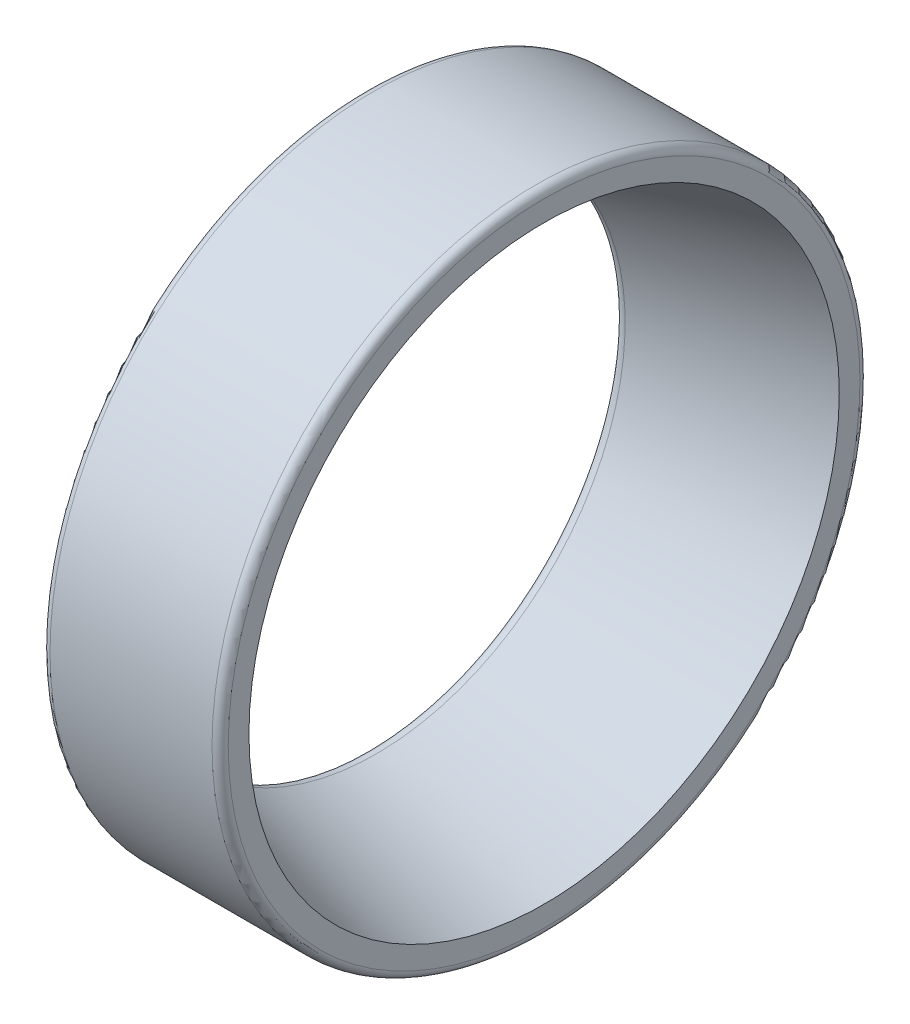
from build123d import *


with BuildPart() as part:
    # Esquisse1 → Base-R_volution (revolve)
    with BuildSketch(Plane(origin=(0, 0, 0), x_dir=(1, 0, 0), z_dir=(0, 1, 0)), mode=Mode.PRIVATE) as base_r_volution_sk:
        with BuildLine():
            Line((0, 15.853652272), (0, 19.5))
            ThreePointArc((0, 19.5), (0.146446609, 19.853553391), (0.5, 20))
            Line((0.5, 20), (10.5, 20))
            ThreePointArc((10.5, 20), (10.853553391, 19.853553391), (11, 19.5))
            Line((11, 19.5), (11, 18.22119127))
            Line((11, 18.22119127), (9.768304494, 17.882641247))
            Line((9.768304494, 17.882641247), (0.873577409, 15.437791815))
            Line((0.873577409, 15.437791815), (0.632517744, 15.371532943))
            ThreePointArc((0.632517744, 15.371532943), (0.196898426, 15.455997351), (0, 15.853652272))
        make_face()
    revolve(base_r_volution_sk.sketch.rotate(Axis((0, 0, 0), (1, 0, 0)), 180), axis=Axis((0, 0, 0), (1, 0, 0)))


solid = part.part
